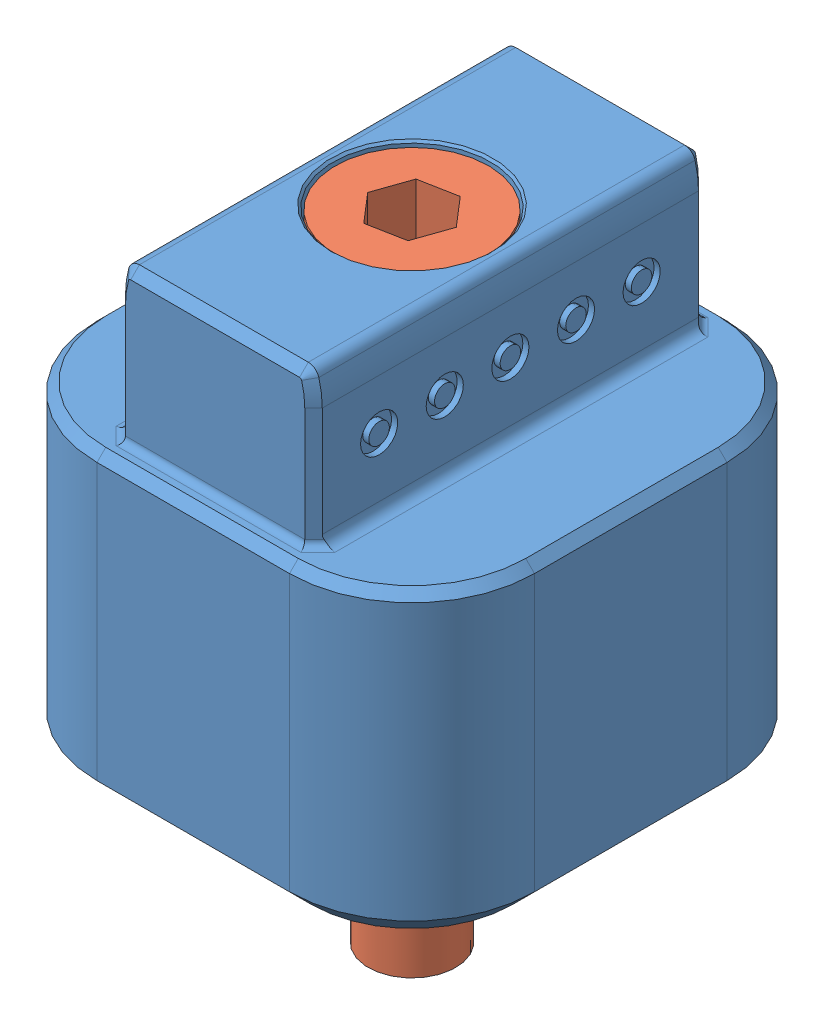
SolidWorks assembly TLM20X20 MALE HALF.SLDASM, configuration Default (file format 13000). Lengths in mm.
Overall size (20 29.2 20).
2 component instances, 2 part files, 1 mates.
Components (placement in the parent):
- TLM20X20-M-1: TLM20X20-M.SLDPRT [Default] at origin size (20 21 20)
- SHCSM4-.7L25-1: SHCSM4-.7L25.SLDPRT [SHCSM4-.7L25] at (0 2.8 0) x (-0.186689 0 -0.982419) z (0 -1 0) size (7 7 29)
Mates (geometry in assembly coordinates):
- ProfileCenter1: profile center: circle of SHCSM4-.7L25-1; plane of TLM20X20-M-1 through (2.5 2.8 0) normal (0 1 0)
